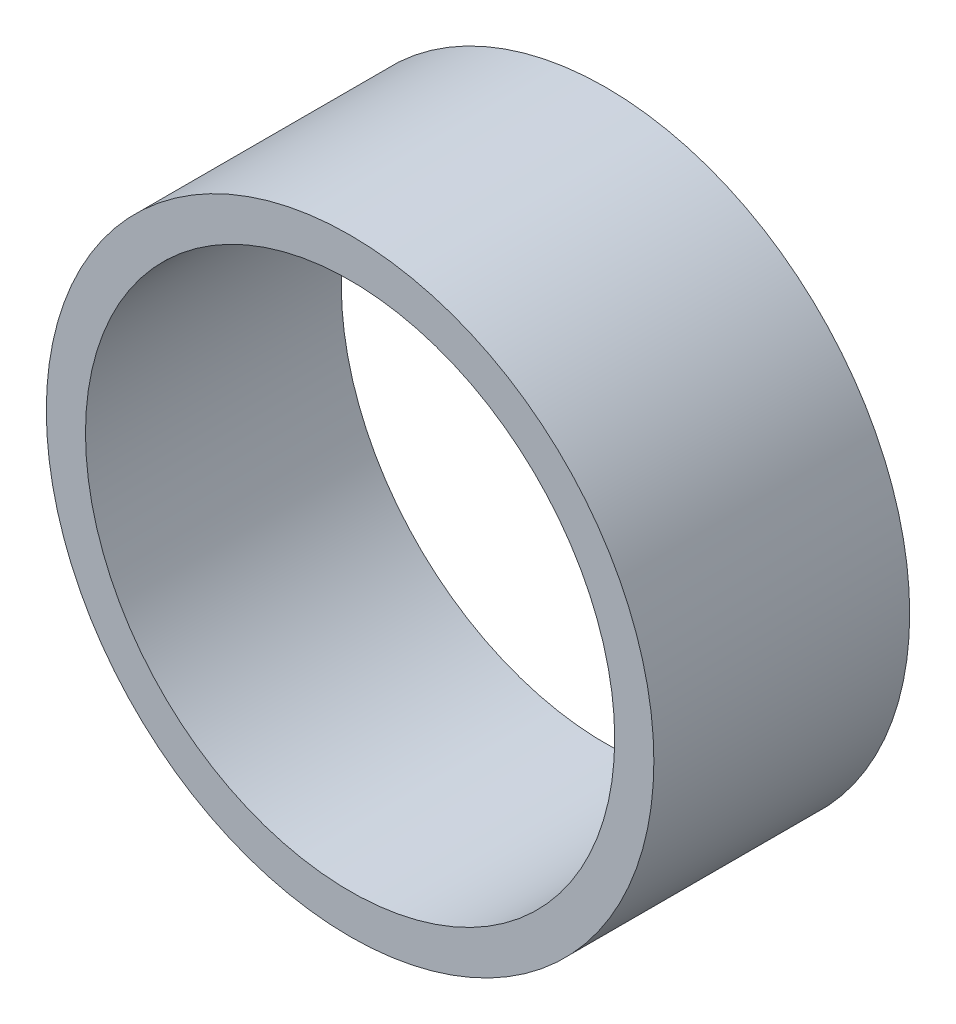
ISO-10303-21;
HEADER;
FILE_DESCRIPTION(('STEP AP214'),'2;1');
FILE_NAME('part.step','',(''),(''),'','','');
FILE_SCHEMA(('AUTOMOTIVE_DESIGN { 1 0 10303 214 1 1 1 1 }'));
ENDSEC;
DATA;
#1=APPLICATION_CONTEXT('core data for automotive mechanical design processes');
#2=APPLICATION_PROTOCOL_DEFINITION('international standard','automotive_design',2000,#1);
#3=PRODUCT_CONTEXT('',#1,'mechanical');
#4=PRODUCT('Part','Part','',(#3));
#5=PRODUCT_RELATED_PRODUCT_CATEGORY('part','',(#4));
#6=PRODUCT_DEFINITION_FORMATION('','',#4);
#7=PRODUCT_DEFINITION_CONTEXT('part definition',#1,'design');
#8=PRODUCT_DEFINITION('design','',#6,#7);
#9=PRODUCT_DEFINITION_SHAPE('','',#8);
#10=(LENGTH_UNIT() NAMED_UNIT(*) SI_UNIT(.MILLI.,.METRE.));
#11=(NAMED_UNIT(*) PLANE_ANGLE_UNIT() SI_UNIT($,.RADIAN.));
#12=(NAMED_UNIT(*) SI_UNIT($,.STERADIAN.) SOLID_ANGLE_UNIT());
#13=UNCERTAINTY_MEASURE_WITH_UNIT(LENGTH_MEASURE(1.E-05),#10,'distance_accuracy_value','');
#14=(GEOMETRIC_REPRESENTATION_CONTEXT(3) GLOBAL_UNCERTAINTY_ASSIGNED_CONTEXT((#13)) GLOBAL_UNIT_ASSIGNED_CONTEXT((#10,
#11,#12)) REPRESENTATION_CONTEXT('',''));
#15=CARTESIAN_POINT('',(0.,0.,0.));
#16=DIRECTION('',(0.,0.,1.));
#17=DIRECTION('',(1.,0.,0.));
#18=AXIS2_PLACEMENT_3D('',#15,#16,#17);
#19=CARTESIAN_POINT('',(0.,0.,-8.));
#20=DIRECTION('',(0.,0.,1.));
#21=DIRECTION('',(1.,0.,0.));
#22=AXIS2_PLACEMENT_3D('',#19,#20,#21);
#23=CYLINDRICAL_SURFACE('',#22,9.5);
#24=CARTESIAN_POINT('',(0.,0.,-8.));
#25=DIRECTION('',(0.,0.,1.));
#26=DIRECTION('',(1.,0.,0.));
#27=AXIS2_PLACEMENT_3D('',#24,#25,#26);
#28=CIRCLE('',#27,9.5);
#29=CARTESIAN_POINT('',(9.5,0.,-8.));
#30=VERTEX_POINT('',#29);
#31=EDGE_CURVE('E10',#30,#30,#28,.T.);
#32=ORIENTED_EDGE('',*,*,#31,.T.);
#33=EDGE_LOOP('',(#32));
#34=FACE_BOUND('',#33,.T.);
#35=CARTESIAN_POINT('',(0.,0.,0.));
#36=DIRECTION('',(0.,0.,1.));
#37=DIRECTION('',(1.,0.,0.));
#38=AXIS2_PLACEMENT_3D('',#35,#36,#37);
#39=CIRCLE('',#38,9.5);
#40=CARTESIAN_POINT('',(9.5,0.,0.));
#41=VERTEX_POINT('',#40);
#42=EDGE_CURVE('E46',#41,#41,#39,.T.);
#43=ORIENTED_EDGE('',*,*,#42,.F.);
#44=EDGE_LOOP('',(#43));
#45=FACE_BOUND('',#44,.T.);
#46=ADVANCED_FACE('F43',(#34,#45),#23,.T.);
#47=CARTESIAN_POINT('',(0.,0.,-8.));
#48=DIRECTION('',(0.,0.,1.));
#49=DIRECTION('',(1.,0.,0.));
#50=AXIS2_PLACEMENT_3D('',#47,#48,#49);
#51=PLANE('',#50);
#52=CARTESIAN_POINT('',(0.,0.,-8.));
#53=DIRECTION('',(0.,0.,1.));
#54=DIRECTION('',(1.,0.,0.));
#55=AXIS2_PLACEMENT_3D('',#52,#53,#54);
#56=CIRCLE('',#55,8.275);
#57=CARTESIAN_POINT('',(8.275,0.,-8.));
#58=VERTEX_POINT('',#57);
#59=EDGE_CURVE('E55',#58,#58,#56,.T.);
#60=ORIENTED_EDGE('',*,*,#59,.T.);
#61=EDGE_LOOP('',(#60));
#62=FACE_BOUND('',#61,.T.);
#63=ORIENTED_EDGE('',*,*,#31,.F.);
#64=EDGE_LOOP('',(#63));
#65=FACE_BOUND('',#64,.T.);
#66=ADVANCED_FACE('F65',(#62,#65),#51,.F.);
#67=CARTESIAN_POINT('',(0.,0.,0.));
#68=DIRECTION('',(0.,0.,1.));
#69=DIRECTION('',(1.,0.,0.));
#70=AXIS2_PLACEMENT_3D('',#67,#68,#69);
#71=PLANE('',#70);
#72=CARTESIAN_POINT('',(0.,0.,0.));
#73=DIRECTION('',(0.,0.,1.));
#74=DIRECTION('',(1.,0.,0.));
#75=AXIS2_PLACEMENT_3D('',#72,#73,#74);
#76=CIRCLE('',#75,8.275);
#77=CARTESIAN_POINT('',(8.275,0.,0.));
#78=VERTEX_POINT('',#77);
#79=EDGE_CURVE('E57',#78,#78,#76,.T.);
#80=ORIENTED_EDGE('',*,*,#79,.F.);
#81=EDGE_LOOP('',(#80));
#82=FACE_BOUND('',#81,.T.);
#83=ORIENTED_EDGE('',*,*,#42,.T.);
#84=EDGE_LOOP('',(#83));
#85=FACE_BOUND('',#84,.T.);
#86=ADVANCED_FACE('F71',(#82,#85),#71,.T.);
#87=CARTESIAN_POINT('',(0.,0.,-8.));
#88=DIRECTION('',(0.,0.,1.));
#89=DIRECTION('',(1.,0.,0.));
#90=AXIS2_PLACEMENT_3D('',#87,#88,#89);
#91=CYLINDRICAL_SURFACE('',#90,8.275);
#92=ORIENTED_EDGE('',*,*,#59,.F.);
#93=EDGE_LOOP('',(#92));
#94=FACE_BOUND('',#93,.T.);
#95=ORIENTED_EDGE('',*,*,#79,.T.);
#96=EDGE_LOOP('',(#95));
#97=FACE_BOUND('',#96,.T.);
#98=ADVANCED_FACE('F68',(#94,#97),#91,.F.);
#99=CLOSED_SHELL('',(#46,#66,#86,#98));
#100=MANIFOLD_SOLID_BREP('B2',#99);
#101=ADVANCED_BREP_SHAPE_REPRESENTATION('',(#18,#100),#14);
#102=SHAPE_DEFINITION_REPRESENTATION(#9,#101);
ENDSEC;
END-ISO-10303-21;
